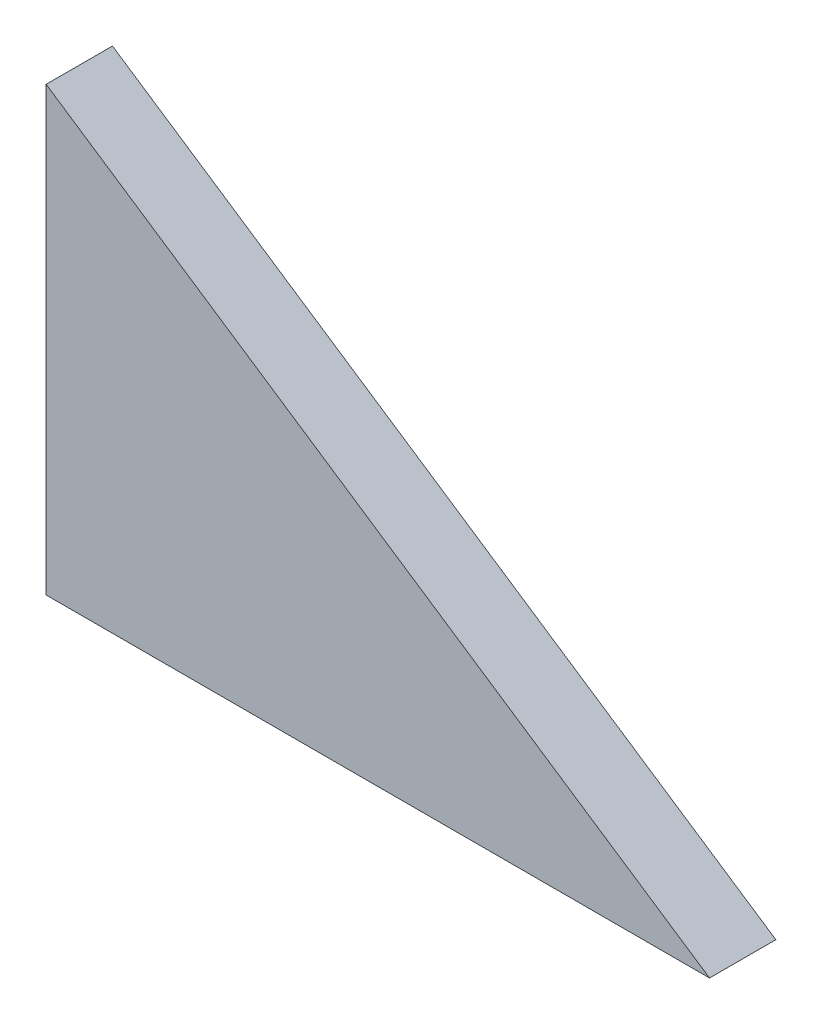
from build123d import *

# Parameters (mm, degrees)
EXTRUSION1_DEPTH = 3


with BuildPart() as part:
    # Esquisse1 → Extrusion1 (new body)
    with BuildSketch(Plane.XY):
        Polygon((0, 0), (0, 20), (30, 0), align=None)
    extrude(amount=EXTRUSION1_DEPTH)


solid = part.part
